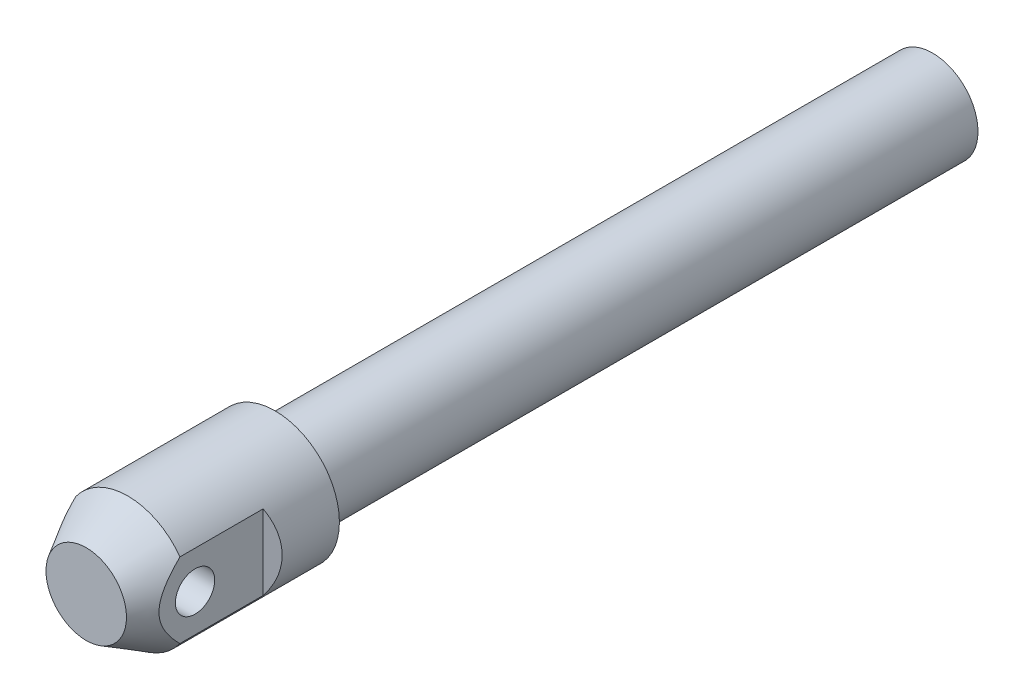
ISO-10303-21;
HEADER;
FILE_DESCRIPTION(('STEP AP214'),'2;1');
FILE_NAME('part.step','',(''),(''),'','','');
FILE_SCHEMA(('AUTOMOTIVE_DESIGN { 1 0 10303 214 1 1 1 1 }'));
ENDSEC;
DATA;
#1=APPLICATION_CONTEXT('core data for automotive mechanical design processes');
#2=APPLICATION_PROTOCOL_DEFINITION('international standard','automotive_design',2000,#1);
#3=PRODUCT_CONTEXT('',#1,'mechanical');
#4=PRODUCT('Part','Part','',(#3));
#5=PRODUCT_RELATED_PRODUCT_CATEGORY('part','',(#4));
#6=PRODUCT_DEFINITION_FORMATION('','',#4);
#7=PRODUCT_DEFINITION_CONTEXT('part definition',#1,'design');
#8=PRODUCT_DEFINITION('design','',#6,#7);
#9=PRODUCT_DEFINITION_SHAPE('','',#8);
#10=(LENGTH_UNIT() NAMED_UNIT(*) SI_UNIT(.MILLI.,.METRE.));
#11=(NAMED_UNIT(*) PLANE_ANGLE_UNIT() SI_UNIT($,.RADIAN.));
#12=(NAMED_UNIT(*) SI_UNIT($,.STERADIAN.) SOLID_ANGLE_UNIT());
#13=UNCERTAINTY_MEASURE_WITH_UNIT(LENGTH_MEASURE(1.E-05),#10,'distance_accuracy_value','');
#14=(GEOMETRIC_REPRESENTATION_CONTEXT(3) GLOBAL_UNCERTAINTY_ASSIGNED_CONTEXT((#13)) GLOBAL_UNIT_ASSIGNED_CONTEXT((#10,
#11,#12)) REPRESENTATION_CONTEXT('',''));
#15=CARTESIAN_POINT('',(0.,0.,0.));
#16=DIRECTION('',(0.,0.,1.));
#17=DIRECTION('',(1.,0.,0.));
#18=AXIS2_PLACEMENT_3D('',#15,#16,#17);
#19=CARTESIAN_POINT('',(0.,0.,20.));
#20=DIRECTION('',(0.,0.,1.));
#21=DIRECTION('',(1.,0.,0.));
#22=AXIS2_PLACEMENT_3D('',#19,#20,#21);
#23=CYLINDRICAL_SURFACE('',#22,8.5);
#24=CARTESIAN_POINT('',(0.,0.,0.));
#25=DIRECTION('',(0.,0.,1.));
#26=DIRECTION('',(1.,0.,0.));
#27=AXIS2_PLACEMENT_3D('',#24,#25,#26);
#28=CIRCLE('',#27,8.5);
#29=CARTESIAN_POINT('',(8.5,0.,0.));
#30=VERTEX_POINT('',#29);
#31=EDGE_CURVE('E82',#30,#30,#28,.T.);
#32=ORIENTED_EDGE('',*,*,#31,.T.);
#33=EDGE_LOOP('',(#32));
#34=FACE_BOUND('',#33,.T.);
#35=CARTESIAN_POINT('',(0.,0.,19.5));
#36=DIRECTION('',(0.,0.,1.));
#37=DIRECTION('',(1.,0.,0.));
#38=AXIS2_PLACEMENT_3D('',#35,#36,#37);
#39=CIRCLE('',#38,8.5);
#40=CARTESIAN_POINT('',(-6.9,-4.96386945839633,19.5));
#41=VERTEX_POINT('',#40);
#42=CARTESIAN_POINT('',(6.9,-4.96386945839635,19.5));
#43=VERTEX_POINT('',#42);
#44=EDGE_CURVE('E67',#41,#43,#39,.T.);
#45=ORIENTED_EDGE('',*,*,#44,.F.);
#46=DIRECTION('',(0.,0.,1.));
#47=VECTOR('',#46,1.);
#48=CARTESIAN_POINT('',(-6.9,-4.96386945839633,20.));
#49=LINE('',#48,#47);
#50=CARTESIAN_POINT('',(-6.9,-4.96386945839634,8.5));
#51=VERTEX_POINT('',#50);
#52=EDGE_CURVE('E30',#41,#51,#49,.F.);
#53=ORIENTED_EDGE('',*,*,#52,.T.);
#54=CARTESIAN_POINT('',(0.,0.,12.4837168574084));
#55=DIRECTION('',(0.5,0.,-0.866025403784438));
#56=DIRECTION('',(0.866025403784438,0.,0.5));
#57=AXIS2_PLACEMENT_3D('',#54,#55,#56);
#58=ELLIPSE('',#57,9.81495457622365,8.5);
#59=CARTESIAN_POINT('',(-6.9,4.96386945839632,8.5));
#60=VERTEX_POINT('',#59);
#61=EDGE_CURVE('E9',#60,#51,#58,.F.);
#62=ORIENTED_EDGE('',*,*,#61,.F.);
#63=DIRECTION('',(0.,0.,1.));
#64=VECTOR('',#63,1.);
#65=CARTESIAN_POINT('',(-6.9,4.96386945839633,20.));
#66=LINE('',#65,#64);
#67=CARTESIAN_POINT('',(-6.9,4.96386945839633,19.5));
#68=VERTEX_POINT('',#67);
#69=EDGE_CURVE('E63',#60,#68,#66,.T.);
#70=ORIENTED_EDGE('',*,*,#69,.T.);
#71=CARTESIAN_POINT('',(6.9,4.96386945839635,19.5));
#72=VERTEX_POINT('',#71);
#73=EDGE_CURVE('E79',#72,#68,#39,.T.);
#74=ORIENTED_EDGE('',*,*,#73,.F.);
#75=DIRECTION('',(0.,0.,1.));
#76=VECTOR('',#75,1.);
#77=CARTESIAN_POINT('',(6.9,4.96386945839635,20.));
#78=LINE('',#77,#76);
#79=CARTESIAN_POINT('',(6.9,4.96386945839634,8.5));
#80=VERTEX_POINT('',#79);
#81=EDGE_CURVE('E38',#80,#72,#78,.T.);
#82=ORIENTED_EDGE('',*,*,#81,.F.);
#83=CARTESIAN_POINT('',(0.,0.,12.4837168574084));
#84=DIRECTION('',(0.5,0.,0.866025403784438));
#85=DIRECTION('',(-0.866025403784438,0.,0.5));
#86=AXIS2_PLACEMENT_3D('',#83,#84,#85);
#87=ELLIPSE('',#86,9.81495457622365,8.5);
#88=CARTESIAN_POINT('',(6.9,-4.96386945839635,8.5));
#89=VERTEX_POINT('',#88);
#90=EDGE_CURVE('E99',#80,#89,#87,.F.);
#91=ORIENTED_EDGE('',*,*,#90,.T.);
#92=DIRECTION('',(0.,0.,1.));
#93=VECTOR('',#92,1.);
#94=CARTESIAN_POINT('',(6.9,-4.96386945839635,20.));
#95=LINE('',#94,#93);
#96=EDGE_CURVE('E74',#43,#89,#95,.F.);
#97=ORIENTED_EDGE('',*,*,#96,.F.);
#98=EDGE_LOOP('',(#45,#53,#62,#70,#74,#82,#91,#97));
#99=FACE_BOUND('',#98,.T.);
#100=ADVANCED_FACE('F14',(#34,#99),#23,.T.);
#101=CARTESIAN_POINT('',(0.,0.,25.));
#102=DIRECTION('',(0.,0.,-1.));
#103=DIRECTION('',(-1.,0.,0.));
#104=AXIS2_PLACEMENT_3D('',#101,#102,#103);
#105=CONICAL_SURFACE('',#104,5.32457351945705,0.523598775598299);
#106=CARTESIAN_POINT('',(0.,0.,25.));
#107=DIRECTION('',(0.,0.,1.));
#108=DIRECTION('',(1.,0.,0.));
#109=AXIS2_PLACEMENT_3D('',#106,#107,#108);
#110=CIRCLE('',#109,5.32457351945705);
#111=CARTESIAN_POINT('',(5.32457351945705,0.,25.));
#112=VERTEX_POINT('',#111);
#113=EDGE_CURVE('E76',#112,#112,#110,.T.);
#114=ORIENTED_EDGE('',*,*,#113,.F.);
#115=EDGE_LOOP('',(#114));
#116=FACE_BOUND('',#115,.T.);
#117=ORIENTED_EDGE('',*,*,#73,.T.);
#118=CARTESIAN_POINT('',(-6.9,-11.7761017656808,10.5822178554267));
#119=CARTESIAN_POINT('',(-6.9,-11.5231895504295,10.9601077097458));
#120=CARTESIAN_POINT('',(-6.9,-11.2688933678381,11.3370811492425));
#121=CARTESIAN_POINT('',(-6.9,-10.7568141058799,12.0887269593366));
#122=CARTESIAN_POINT('',(-6.9,-10.4990305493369,12.463399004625));
#123=CARTESIAN_POINT('',(-6.9,-9.97780567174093,13.2120543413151));
#124=CARTESIAN_POINT('',(-6.9,-9.71434006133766,13.5860207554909));
#125=CARTESIAN_POINT('',(-6.9,-9.18227914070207,14.3302524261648));
#126=CARTESIAN_POINT('',(-6.9,-8.91368421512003,14.7005179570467));
#127=CARTESIAN_POINT('',(-6.9,-8.34932474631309,15.4644043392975));
#128=CARTESIAN_POINT('',(-6.9,-8.05305141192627,15.8576502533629));
#129=CARTESIAN_POINT('',(-6.9,-7.45080501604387,16.6368491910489));
#130=CARTESIAN_POINT('',(-6.9,-7.14482967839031,17.0228004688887));
#131=CARTESIAN_POINT('',(-6.9,-6.6766500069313,17.5933456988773));
#132=CARTESIAN_POINT('',(-6.9,-6.51926271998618,17.7818929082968));
#133=CARTESIAN_POINT('',(-6.9,-6.20075094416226,18.1557986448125));
#134=CARTESIAN_POINT('',(-6.9,-6.03962662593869,18.3411573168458));
#135=CARTESIAN_POINT('',(-6.9,-5.71305851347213,18.7078973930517));
#136=CARTESIAN_POINT('',(-6.9,-5.5476165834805,18.8892804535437));
#137=CARTESIAN_POINT('',(-6.9,-5.21155976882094,19.2471747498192));
#138=CARTESIAN_POINT('',(-6.9,-5.04094553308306,19.4236865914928));
#139=CARTESIAN_POINT('',(-6.9,-4.77365811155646,19.6905380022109));
#140=CARTESIAN_POINT('',(-6.9,-4.67917608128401,19.7830731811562));
#141=CARTESIAN_POINT('',(-6.9,-4.48823074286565,19.9660758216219));
#142=CARTESIAN_POINT('',(-6.9,-4.39176740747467,20.0565432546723));
#143=CARTESIAN_POINT('',(-6.9,-4.09900157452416,20.3244893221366));
#144=CARTESIAN_POINT('',(-6.9,-3.89940853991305,20.4984256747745));
#145=CARTESIAN_POINT('',(-6.9,-3.49142942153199,20.831987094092));
#146=CARTESIAN_POINT('',(-6.9,-3.28313521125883,20.9917237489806));
#147=CARTESIAN_POINT('',(-6.9,-2.85419187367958,21.2936225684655));
#148=CARTESIAN_POINT('',(-6.9,-2.63355523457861,21.4358020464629));
#149=CARTESIAN_POINT('',(-6.9,-2.29148211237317,21.6308550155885));
#150=CARTESIAN_POINT('',(-6.9,-2.17530299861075,21.6929677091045));
#151=CARTESIAN_POINT('',(-6.9,-1.93925517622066,21.8097877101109));
#152=CARTESIAN_POINT('',(-6.9,-1.81938670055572,21.8644954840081));
#153=CARTESIAN_POINT('',(-6.9,-1.57611618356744,21.9651631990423));
#154=CARTESIAN_POINT('',(-6.9,-1.45271707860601,22.0111301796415));
#155=CARTESIAN_POINT('',(-6.9,-1.20262499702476,22.0929750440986));
#156=CARTESIAN_POINT('',(-6.9,-1.07593300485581,22.1288559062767));
#157=CARTESIAN_POINT('',(-6.9,-0.81803747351,22.1896453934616));
#158=CARTESIAN_POINT('',(-6.9,-0.686795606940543,22.2143934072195));
#159=CARTESIAN_POINT('',(-6.9,-0.422520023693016,22.2510678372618));
#160=CARTESIAN_POINT('',(-6.9,-0.28948644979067,22.2629952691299));
#161=CARTESIAN_POINT('',(-6.9,-0.0229498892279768,22.2734421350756));
#162=CARTESIAN_POINT('',(-6.9,0.110552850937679,22.2719677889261));
#163=CARTESIAN_POINT('',(-6.9,0.376736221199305,22.255698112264));
#164=CARTESIAN_POINT('',(-6.9,0.509416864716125,22.240902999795));
#165=CARTESIAN_POINT('',(-6.9,0.75437583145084,22.201658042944));
#166=CARTESIAN_POINT('',(-6.9,0.866921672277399,22.1788401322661));
#167=CARTESIAN_POINT('',(-6.9,1.08992709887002,22.1246116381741));
#168=CARTESIAN_POINT('',(-6.9,1.20038639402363,22.0931998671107));
#169=CARTESIAN_POINT('',(-6.9,1.41880965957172,22.0226572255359));
#170=CARTESIAN_POINT('',(-6.9,1.5267732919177,21.9835253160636));
#171=CARTESIAN_POINT('',(-6.9,1.73997734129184,21.8984603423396));
#172=CARTESIAN_POINT('',(-6.9,1.84521740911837,21.8525264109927));
#173=CARTESIAN_POINT('',(-6.9,2.14889405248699,21.7095499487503));
#174=CARTESIAN_POINT('',(-6.9,2.34358024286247,21.6045045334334));
#175=CARTESIAN_POINT('',(-6.9,2.72313106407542,21.3779419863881));
#176=CARTESIAN_POINT('',(-6.9,2.90798625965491,21.2564094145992));
#177=CARTESIAN_POINT('',(-6.9,3.27087204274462,20.9996234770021));
#178=CARTESIAN_POINT('',(-6.9,3.44880642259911,20.8642351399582));
#179=CARTESIAN_POINT('',(-6.9,3.7098354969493,20.6540525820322));
#180=CARTESIAN_POINT('',(-6.9,3.79584813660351,20.5828248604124));
#181=CARTESIAN_POINT('',(-6.9,3.96609034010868,20.4382705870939));
#182=CARTESIAN_POINT('',(-6.9,4.05031994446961,20.364944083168));
#183=CARTESIAN_POINT('',(-6.9,4.30479429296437,20.138432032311));
#184=CARTESIAN_POINT('',(-6.9,4.47241760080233,19.9822974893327));
#185=CARTESIAN_POINT('',(-6.9,4.80186670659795,19.6640064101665));
#186=CARTESIAN_POINT('',(-6.9,4.96369131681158,19.5018486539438));
#187=CARTESIAN_POINT('',(-6.9,5.28251775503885,19.1726539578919));
#188=CARTESIAN_POINT('',(-6.9,5.43951614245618,19.0056136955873));
#189=CARTESIAN_POINT('',(-6.9,5.74931497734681,18.66767507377));
#190=CARTESIAN_POINT('',(-6.9,5.90211512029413,18.4967764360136));
#191=CARTESIAN_POINT('',(-6.9,6.20467395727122,18.1511845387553));
#192=CARTESIAN_POINT('',(-6.9,6.35441915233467,17.9764794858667));
#193=CARTESIAN_POINT('',(-6.9,6.65077710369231,17.6244291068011));
#194=CARTESIAN_POINT('',(-6.9,6.79738975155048,17.4470836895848));
#195=CARTESIAN_POINT('',(-6.9,7.23319368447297,16.9117145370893));
#196=CARTESIAN_POINT('',(-6.9,7.51832840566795,16.550383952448));
#197=CARTESIAN_POINT('',(-6.9,7.92704025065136,16.0201612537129));
#198=CARTESIAN_POINT('',(-6.9,8.05391970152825,15.8537878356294));
#199=CARTESIAN_POINT('',(-6.9,8.30612549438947,15.5198844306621));
#200=CARTESIAN_POINT('',(-6.9,8.43145194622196,15.3523545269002));
#201=CARTESIAN_POINT('',(-6.9,8.80539763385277,14.8481828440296));
#202=CARTESIAN_POINT('',(-6.9,9.0519473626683,14.5100057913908));
#203=CARTESIAN_POINT('',(-6.9,9.53839906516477,13.8334497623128));
#204=CARTESIAN_POINT('',(-6.9,9.77834058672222,13.4950991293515));
#205=CARTESIAN_POINT('',(-6.9,10.254496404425,12.8158866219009));
#206=CARTESIAN_POINT('',(-6.9,10.4907114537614,12.4750252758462));
#207=CARTESIAN_POINT('',(-6.9,10.7254504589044,12.1331615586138));
#208=B_SPLINE_CURVE_WITH_KNOTS('',3,(#118,#119,#120,#121,#122,#123,#124,#125,#126,#127,#128,
#129,#130,#131,#132,#133,#134,#135,#136,#137,#138,#139,#140,#141,#142,#143,#144,#145,#146,#147,
#148,#149,#150,#151,#152,#153,#154,#155,#156,#157,#158,#159,#160,#161,#162,#163,#164,#165,#166,
#167,#168,#169,#170,#171,#172,#173,#174,#175,#176,#177,#178,#179,#180,#181,#182,#183,#184,#185,
#186,#187,#188,#189,#190,#191,#192,#193,#194,#195,#196,#197,#198,#199,#200,#201,#202,#203,#204,
#205,#206,#207),.UNSPECIFIED.,.F.,.F.,(4,2,2,2,2,2,2,2,2,2,2,2,2,2,2,2,2,2,2,2,2,2,2,2,2,2,2,2,
2,2,2,2,2,2,2,2,2,2,2,2,2,2,2,2,4),(0.,1.36415288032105,2.72849434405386,4.10082414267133,
5.47305143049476,6.95003664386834,8.42737097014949,9.16414178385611,9.90087901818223,
10.6373032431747,11.3736354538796,11.7703519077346,12.1670738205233,12.9608807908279,
13.7477643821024,14.5338657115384,14.9288783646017,15.3238661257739,15.7185344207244,
16.1130860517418,16.5131603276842,16.9132029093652,17.3130598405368,17.7129102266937,
18.0570632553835,18.4012638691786,18.7455108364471,19.0898017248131,19.7522599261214,
20.4153428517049,21.0856446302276,21.4206479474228,21.7556436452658,22.4426581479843,
23.1298125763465,23.8174460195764,24.5051292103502,25.1953821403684,25.8856589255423,
27.2663158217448,27.8940115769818,28.5216626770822,29.7771414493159,31.0214951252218,
32.2655939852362),.UNSPECIFIED.);
#209=EDGE_CURVE('E23',#68,#41,#208,.F.);
#210=ORIENTED_EDGE('',*,*,#209,.T.);
#211=ORIENTED_EDGE('',*,*,#44,.T.);
#212=CARTESIAN_POINT('',(6.9,-11.7761017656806,10.582217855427));
#213=CARTESIAN_POINT('',(6.9,-11.5231895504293,10.960107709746));
#214=CARTESIAN_POINT('',(6.9,-11.2688933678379,11.3370811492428));
#215=CARTESIAN_POINT('',(6.9,-10.7568141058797,12.0887269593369));
#216=CARTESIAN_POINT('',(6.9,-10.4990305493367,12.4633990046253));
#217=CARTESIAN_POINT('',(6.9,-9.97780567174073,13.2120543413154));
#218=CARTESIAN_POINT('',(6.9,-9.71434006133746,13.5860207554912));
#219=CARTESIAN_POINT('',(6.9,-9.18227914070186,14.3302524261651));
#220=CARTESIAN_POINT('',(6.9,-8.91368421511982,14.700517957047));
#221=CARTESIAN_POINT('',(6.9,-8.34932474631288,15.4644043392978));
#222=CARTESIAN_POINT('',(6.9,-8.05305141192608,15.8576502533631));
#223=CARTESIAN_POINT('',(6.9,-7.45080501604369,16.6368491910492));
#224=CARTESIAN_POINT('',(6.9,-7.14482967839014,17.0228004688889));
#225=CARTESIAN_POINT('',(6.9,-6.67665000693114,17.5933456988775));
#226=CARTESIAN_POINT('',(6.9,-6.51926271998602,17.781892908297));
#227=CARTESIAN_POINT('',(6.9,-6.20075094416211,18.1557986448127));
#228=CARTESIAN_POINT('',(6.9,-6.03962662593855,18.3411573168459));
#229=CARTESIAN_POINT('',(6.9,-5.71305851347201,18.7078973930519));
#230=CARTESIAN_POINT('',(6.9,-5.54761658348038,18.8892804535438));
#231=CARTESIAN_POINT('',(6.9,-5.21155976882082,19.2471747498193));
#232=CARTESIAN_POINT('',(6.9,-5.04094553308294,19.4236865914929));
#233=CARTESIAN_POINT('',(6.9,-4.77365811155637,19.690538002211));
#234=CARTESIAN_POINT('',(6.9,-4.67917608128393,19.7830731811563));
#235=CARTESIAN_POINT('',(6.9,-4.48823074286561,19.9660758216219));
#236=CARTESIAN_POINT('',(6.9,-4.39176740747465,20.0565432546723));
#237=CARTESIAN_POINT('',(6.9,-4.0990015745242,20.3244893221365));
#238=CARTESIAN_POINT('',(6.9,-3.89940853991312,20.4984256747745));
#239=CARTESIAN_POINT('',(6.9,-3.49142942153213,20.8319870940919));
#240=CARTESIAN_POINT('',(6.9,-3.28313521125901,20.9917237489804));
#241=CARTESIAN_POINT('',(6.9,-2.85419187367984,21.2936225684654));
#242=CARTESIAN_POINT('',(6.9,-2.63355523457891,21.4358020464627));
#243=CARTESIAN_POINT('',(6.9,-2.29148211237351,21.6308550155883));
#244=CARTESIAN_POINT('',(6.9,-2.17530299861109,21.6929677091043));
#245=CARTESIAN_POINT('',(6.9,-1.93925517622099,21.8097877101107));
#246=CARTESIAN_POINT('',(6.9,-1.81938670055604,21.864495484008));
#247=CARTESIAN_POINT('',(6.9,-1.57611618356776,21.9651631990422));
#248=CARTESIAN_POINT('',(6.9,-1.45271707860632,22.0111301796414));
#249=CARTESIAN_POINT('',(6.9,-1.20262499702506,22.0929750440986));
#250=CARTESIAN_POINT('',(6.9,-1.07593300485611,22.1288559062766));
#251=CARTESIAN_POINT('',(6.9,-0.818037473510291,22.1896453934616));
#252=CARTESIAN_POINT('',(6.9,-0.686795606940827,22.2143934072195));
#253=CARTESIAN_POINT('',(6.9,-0.422520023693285,22.2510678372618));
#254=CARTESIAN_POINT('',(6.9,-0.289486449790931,22.2629952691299));
#255=CARTESIAN_POINT('',(6.9,-0.022949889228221,22.2734421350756));
#256=CARTESIAN_POINT('',(6.9,0.110552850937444,22.2719677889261));
#257=CARTESIAN_POINT('',(6.9,0.376736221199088,22.2556981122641));
#258=CARTESIAN_POINT('',(6.9,0.509416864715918,22.240902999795));
#259=CARTESIAN_POINT('',(6.9,0.754375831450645,22.2016580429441));
#260=CARTESIAN_POINT('',(6.9,0.866921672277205,22.1788401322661));
#261=CARTESIAN_POINT('',(6.9,1.08992709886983,22.1246116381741));
#262=CARTESIAN_POINT('',(6.9,1.20038639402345,22.0931998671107));
#263=CARTESIAN_POINT('',(6.9,1.41880965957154,22.022657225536));
#264=CARTESIAN_POINT('',(6.9,1.52677329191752,21.9835253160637));
#265=CARTESIAN_POINT('',(6.9,1.73997734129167,21.8984603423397));
#266=CARTESIAN_POINT('',(6.9,1.84521740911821,21.8525264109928));
#267=CARTESIAN_POINT('',(6.9,2.14889405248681,21.7095499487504));
#268=CARTESIAN_POINT('',(6.9,2.34358024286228,21.6045045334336));
#269=CARTESIAN_POINT('',(6.9,2.72313106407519,21.3779419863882));
#270=CARTESIAN_POINT('',(6.9,2.90798625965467,21.2564094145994));
#271=CARTESIAN_POINT('',(6.9,3.27087204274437,20.9996234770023));
#272=CARTESIAN_POINT('',(6.9,3.44880642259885,20.8642351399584));
#273=CARTESIAN_POINT('',(6.9,3.70983549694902,20.6540525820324));
#274=CARTESIAN_POINT('',(6.9,3.79584813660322,20.5828248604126));
#275=CARTESIAN_POINT('',(6.9,3.96609034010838,20.4382705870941));
#276=CARTESIAN_POINT('',(6.9,4.05031994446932,20.3649440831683));
#277=CARTESIAN_POINT('',(6.9,4.30479429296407,20.1384320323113));
#278=CARTESIAN_POINT('',(6.9,4.47241760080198,19.982297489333));
#279=CARTESIAN_POINT('',(6.9,4.80186670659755,19.6640064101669));
#280=CARTESIAN_POINT('',(6.9,4.96369131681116,19.5018486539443));
#281=CARTESIAN_POINT('',(6.9,5.2825177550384,19.1726539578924));
#282=CARTESIAN_POINT('',(6.9,5.43951614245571,19.0056136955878));
#283=CARTESIAN_POINT('',(6.9,5.74931497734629,18.6676750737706));
#284=CARTESIAN_POINT('',(6.9,5.90211512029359,18.4967764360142));
#285=CARTESIAN_POINT('',(6.9,6.20467395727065,18.151184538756));
#286=CARTESIAN_POINT('',(6.9,6.35441915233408,17.9764794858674));
#287=CARTESIAN_POINT('',(6.9,6.65077710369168,17.6244291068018));
#288=CARTESIAN_POINT('',(6.9,6.79738975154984,17.4470836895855));
#289=CARTESIAN_POINT('',(6.9,7.23319368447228,16.9117145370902));
#290=CARTESIAN_POINT('',(6.9,7.51832840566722,16.5503839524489));
#291=CARTESIAN_POINT('',(6.9,7.92704025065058,16.0201612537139));
#292=CARTESIAN_POINT('',(6.9,8.05391970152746,15.8537878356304));
#293=CARTESIAN_POINT('',(6.9,8.30612549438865,15.5198844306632));
#294=CARTESIAN_POINT('',(6.9,8.43145194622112,15.3523545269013));
#295=CARTESIAN_POINT('',(6.9,8.80539763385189,14.8481828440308));
#296=CARTESIAN_POINT('',(6.9,9.05194736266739,14.5100057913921));
#297=CARTESIAN_POINT('',(6.9,9.5383990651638,13.8334497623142));
#298=CARTESIAN_POINT('',(6.9,9.77834058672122,13.4950991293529));
#299=CARTESIAN_POINT('',(6.9,10.254496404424,12.8158866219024));
#300=CARTESIAN_POINT('',(6.9,10.4907114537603,12.4750252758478));
#301=CARTESIAN_POINT('',(6.9,10.7254504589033,12.1331615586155));
#302=B_SPLINE_CURVE_WITH_KNOTS('',3,(#212,#213,#214,#215,#216,#217,#218,#219,#220,#221,#222,
#223,#224,#225,#226,#227,#228,#229,#230,#231,#232,#233,#234,#235,#236,#237,#238,#239,#240,#241,
#242,#243,#244,#245,#246,#247,#248,#249,#250,#251,#252,#253,#254,#255,#256,#257,#258,#259,#260,
#261,#262,#263,#264,#265,#266,#267,#268,#269,#270,#271,#272,#273,#274,#275,#276,#277,#278,#279,
#280,#281,#282,#283,#284,#285,#286,#287,#288,#289,#290,#291,#292,#293,#294,#295,#296,#297,#298,
#299,#300,#301),.UNSPECIFIED.,.F.,.F.,(4,2,2,2,2,2,2,2,2,2,2,2,2,2,2,2,2,2,2,2,2,2,2,2,2,2,2,2,
2,2,2,2,2,2,2,2,2,2,2,2,2,2,2,2,4),(0.,1.36415288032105,2.72849434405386,4.10082414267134,
5.47305143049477,6.9500366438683,8.4273709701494,9.16414178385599,9.90087901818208,
10.6373032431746,11.3736354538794,11.7703519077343,12.167073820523,12.9608807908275,
13.7477643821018,14.5338657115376,14.928878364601,15.3238661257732,15.7185344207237,
16.1130860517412,16.5131603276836,16.9132029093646,17.3130598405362,17.7129102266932,
18.057063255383,18.4012638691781,18.7455108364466,19.0898017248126,19.7522599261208,
20.4153428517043,21.0856446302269,21.4206479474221,21.7556436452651,22.4426581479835,
23.1298125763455,23.8174460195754,24.5051292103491,25.1953821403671,25.885658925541,
27.2663158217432,27.8940115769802,28.5216626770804,29.777141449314,31.0214951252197,
32.2655939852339),.UNSPECIFIED.);
#303=EDGE_CURVE('E91',#72,#43,#302,.F.);
#304=ORIENTED_EDGE('',*,*,#303,.F.);
#305=EDGE_LOOP('',(#117,#210,#211,#304));
#306=FACE_BOUND('',#305,.T.);
#307=ADVANCED_FACE('F104',(#116,#306),#105,.T.);
#308=CARTESIAN_POINT('',(0.,5.32457351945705,25.));
#309=DIRECTION('',(0.,0.,-1.));
#310=DIRECTION('',(-1.,0.,0.));
#311=AXIS2_PLACEMENT_3D('',#308,#309,#310);
#312=PLANE('',#311);
#313=ORIENTED_EDGE('',*,*,#113,.T.);
#314=EDGE_LOOP('',(#313));
#315=FACE_BOUND('',#314,.T.);
#316=ADVANCED_FACE('F16',(#315),#312,.F.);
#317=CARTESIAN_POINT('',(0.,6.,-87.));
#318=DIRECTION('',(0.,0.,-1.));
#319=DIRECTION('',(-1.,0.,0.));
#320=AXIS2_PLACEMENT_3D('',#317,#318,#319);
#321=PLANE('',#320);
#322=CARTESIAN_POINT('',(0.,0.,-87.));
#323=DIRECTION('',(0.,0.,1.));
#324=DIRECTION('',(1.,0.,0.));
#325=AXIS2_PLACEMENT_3D('',#322,#323,#324);
#326=CIRCLE('',#325,6.);
#327=CARTESIAN_POINT('',(6.,0.,-87.));
#328=VERTEX_POINT('',#327);
#329=EDGE_CURVE('E88',#328,#328,#326,.T.);
#330=ORIENTED_EDGE('',*,*,#329,.F.);
#331=EDGE_LOOP('',(#330));
#332=FACE_BOUND('',#331,.T.);
#333=ADVANCED_FACE('F147',(#332),#321,.T.);
#334=CARTESIAN_POINT('',(0.,0.,20.));
#335=DIRECTION('',(0.,0.,1.));
#336=DIRECTION('',(1.,0.,0.));
#337=AXIS2_PLACEMENT_3D('',#334,#335,#336);
#338=CYLINDRICAL_SURFACE('',#337,6.);
#339=ORIENTED_EDGE('',*,*,#329,.T.);
#340=EDGE_LOOP('',(#339));
#341=FACE_BOUND('',#340,.T.);
#342=CARTESIAN_POINT('',(0.,0.,0.));
#343=DIRECTION('',(0.,0.,1.));
#344=DIRECTION('',(1.,0.,0.));
#345=AXIS2_PLACEMENT_3D('',#342,#343,#344);
#346=CIRCLE('',#345,6.);
#347=CARTESIAN_POINT('',(6.,0.,0.));
#348=VERTEX_POINT('',#347);
#349=EDGE_CURVE('E85',#348,#348,#346,.T.);
#350=ORIENTED_EDGE('',*,*,#349,.F.);
#351=EDGE_LOOP('',(#350));
#352=FACE_BOUND('',#351,.T.);
#353=ADVANCED_FACE('F134',(#341,#352),#338,.T.);
#354=CARTESIAN_POINT('',(0.,6.,0.));
#355=DIRECTION('',(0.,0.,1.));
#356=DIRECTION('',(1.,0.,0.));
#357=AXIS2_PLACEMENT_3D('',#354,#355,#356);
#358=PLANE('',#357);
#359=ORIENTED_EDGE('',*,*,#31,.F.);
#360=EDGE_LOOP('',(#359));
#361=FACE_BOUND('',#360,.T.);
#362=ORIENTED_EDGE('',*,*,#349,.T.);
#363=EDGE_LOOP('',(#362));
#364=FACE_BOUND('',#363,.T.);
#365=ADVANCED_FACE('F125',(#361,#364),#358,.F.);
#366=CARTESIAN_POINT('',(6.9,-15.,8.5));
#367=DIRECTION('',(0.5,0.,0.866025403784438));
#368=DIRECTION('',(0.866025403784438,0.,-0.5));
#369=AXIS2_PLACEMENT_3D('',#366,#367,#368);
#370=PLANE('',#369);
#371=DIRECTION('',(0.,1.,0.));
#372=VECTOR('',#371,1.);
#373=CARTESIAN_POINT('',(6.9,-15.,8.5));
#374=LINE('',#373,#372);
#375=EDGE_CURVE('E68',#89,#80,#374,.T.);
#376=ORIENTED_EDGE('',*,*,#375,.F.);
#377=ORIENTED_EDGE('',*,*,#90,.F.);
#378=EDGE_LOOP('',(#376,#377));
#379=FACE_BOUND('',#378,.T.);
#380=ADVANCED_FACE('F123',(#379),#370,.T.);
#381=CARTESIAN_POINT('',(6.9,-15.,8.5));
#382=DIRECTION('',(-1.,0.,0.));
#383=DIRECTION('',(0.,0.,1.));
#384=AXIS2_PLACEMENT_3D('',#381,#382,#383);
#385=PLANE('',#384);
#386=CARTESIAN_POINT('',(6.9,0.,17.5));
#387=DIRECTION('',(1.,0.,0.));
#388=DIRECTION('',(0.,0.,-1.));
#389=AXIS2_PLACEMENT_3D('',#386,#387,#388);
#390=CIRCLE('',#389,2.6);
#391=CARTESIAN_POINT('',(6.9,0.,14.9));
#392=VERTEX_POINT('',#391);
#393=EDGE_CURVE('E233',#392,#392,#390,.T.);
#394=ORIENTED_EDGE('',*,*,#393,.F.);
#395=EDGE_LOOP('',(#394));
#396=FACE_BOUND('',#395,.T.);
#397=ORIENTED_EDGE('',*,*,#96,.T.);
#398=ORIENTED_EDGE('',*,*,#375,.T.);
#399=ORIENTED_EDGE('',*,*,#81,.T.);
#400=ORIENTED_EDGE('',*,*,#303,.T.);
#401=EDGE_LOOP('',(#397,#398,#399,#400));
#402=FACE_BOUND('',#401,.T.);
#403=ADVANCED_FACE('F101',(#396,#402),#385,.F.);
#404=CARTESIAN_POINT('',(-6.9,-15.,8.5));
#405=DIRECTION('',(-1.,0.,0.));
#406=DIRECTION('',(0.,0.,1.));
#407=AXIS2_PLACEMENT_3D('',#404,#405,#406);
#408=PLANE('',#407);
#409=CARTESIAN_POINT('',(-6.9,0.,17.5));
#410=DIRECTION('',(-1.,0.,0.));
#411=DIRECTION('',(0.,0.,1.));
#412=AXIS2_PLACEMENT_3D('',#409,#410,#411);
#413=CIRCLE('',#412,2.6);
#414=CARTESIAN_POINT('',(-6.9,0.,20.1));
#415=VERTEX_POINT('',#414);
#416=EDGE_CURVE('E18',#415,#415,#413,.T.);
#417=ORIENTED_EDGE('',*,*,#416,.F.);
#418=EDGE_LOOP('',(#417));
#419=FACE_BOUND('',#418,.T.);
#420=ORIENTED_EDGE('',*,*,#209,.F.);
#421=ORIENTED_EDGE('',*,*,#69,.F.);
#422=DIRECTION('',(0.,1.,0.));
#423=VECTOR('',#422,1.);
#424=CARTESIAN_POINT('',(-6.9,-15.,8.5));
#425=LINE('',#424,#423);
#426=EDGE_CURVE('E59',#51,#60,#425,.T.);
#427=ORIENTED_EDGE('',*,*,#426,.F.);
#428=ORIENTED_EDGE('',*,*,#52,.F.);
#429=EDGE_LOOP('',(#420,#421,#427,#428));
#430=FACE_BOUND('',#429,.T.);
#431=ADVANCED_FACE('F62',(#419,#430),#408,.T.);
#432=CARTESIAN_POINT('',(-6.9,-15.,8.5));
#433=DIRECTION('',(0.5,0.,-0.866025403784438));
#434=DIRECTION('',(-0.866025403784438,0.,-0.5));
#435=AXIS2_PLACEMENT_3D('',#432,#433,#434);
#436=PLANE('',#435);
#437=ORIENTED_EDGE('',*,*,#61,.T.);
#438=ORIENTED_EDGE('',*,*,#426,.T.);
#439=EDGE_LOOP('',(#437,#438));
#440=FACE_BOUND('',#439,.T.);
#441=ADVANCED_FACE('F58',(#440),#436,.F.);
#442=CARTESIAN_POINT('',(-8.5,0.,17.5));
#443=DIRECTION('',(1.,0.,0.));
#444=DIRECTION('',(0.,0.,-1.));
#445=AXIS2_PLACEMENT_3D('',#442,#443,#444);
#446=CYLINDRICAL_SURFACE('',#445,2.6);
#447=ORIENTED_EDGE('',*,*,#416,.T.);
#448=EDGE_LOOP('',(#447));
#449=FACE_BOUND('',#448,.T.);
#450=ORIENTED_EDGE('',*,*,#393,.T.);
#451=EDGE_LOOP('',(#450));
#452=FACE_BOUND('',#451,.T.);
#453=ADVANCED_FACE('F121',(#449,#452),#446,.F.);
#454=CLOSED_SHELL('',(#100,#307,#316,#333,#353,#365,#380,#403,#431,#441,#453));
#455=MANIFOLD_SOLID_BREP('B1',#454);
#456=ADVANCED_BREP_SHAPE_REPRESENTATION('',(#18,#455),#14);
#457=SHAPE_DEFINITION_REPRESENTATION(#9,#456);
ENDSEC;
END-ISO-10303-21;
